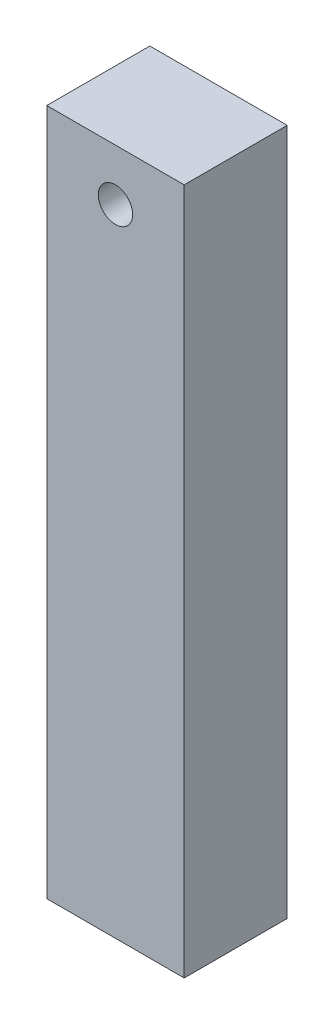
ISO-10303-21;
HEADER;
FILE_DESCRIPTION(('STEP AP214'),'2;1');
FILE_NAME('part.step','',(''),(''),'','','');
FILE_SCHEMA(('AUTOMOTIVE_DESIGN { 1 0 10303 214 1 1 1 1 }'));
ENDSEC;
DATA;
#1=APPLICATION_CONTEXT('core data for automotive mechanical design processes');
#2=APPLICATION_PROTOCOL_DEFINITION('international standard','automotive_design',2000,#1);
#3=PRODUCT_CONTEXT('',#1,'mechanical');
#4=PRODUCT('Part','Part','',(#3));
#5=PRODUCT_RELATED_PRODUCT_CATEGORY('part','',(#4));
#6=PRODUCT_DEFINITION_FORMATION('','',#4);
#7=PRODUCT_DEFINITION_CONTEXT('part definition',#1,'design');
#8=PRODUCT_DEFINITION('design','',#6,#7);
#9=PRODUCT_DEFINITION_SHAPE('','',#8);
#10=(LENGTH_UNIT() NAMED_UNIT(*) SI_UNIT(.MILLI.,.METRE.));
#11=(NAMED_UNIT(*) PLANE_ANGLE_UNIT() SI_UNIT($,.RADIAN.));
#12=(NAMED_UNIT(*) SI_UNIT($,.STERADIAN.) SOLID_ANGLE_UNIT());
#13=UNCERTAINTY_MEASURE_WITH_UNIT(LENGTH_MEASURE(1.E-05),#10,'distance_accuracy_value','');
#14=(GEOMETRIC_REPRESENTATION_CONTEXT(3) GLOBAL_UNCERTAINTY_ASSIGNED_CONTEXT((#13)) GLOBAL_UNIT_ASSIGNED_CONTEXT((#10,
#11,#12)) REPRESENTATION_CONTEXT('',''));
#15=CARTESIAN_POINT('',(0.,0.,0.));
#16=DIRECTION('',(0.,0.,1.));
#17=DIRECTION('',(1.,0.,0.));
#18=AXIS2_PLACEMENT_3D('',#15,#16,#17);
#19=CARTESIAN_POINT('',(0.,40.,0.));
#20=DIRECTION('',(1.,0.,0.));
#21=DIRECTION('',(0.,0.,-1.));
#22=AXIS2_PLACEMENT_3D('',#19,#20,#21);
#23=PLANE('',#22);
#24=DIRECTION('',(0.,0.,1.));
#25=VECTOR('',#24,1.);
#26=CARTESIAN_POINT('',(0.,0.,0.));
#27=LINE('',#26,#25);
#28=CARTESIAN_POINT('',(0.,0.,-6.));
#29=VERTEX_POINT('',#28);
#30=CARTESIAN_POINT('',(0.,0.,0.));
#31=VERTEX_POINT('',#30);
#32=EDGE_CURVE('E70',#29,#31,#27,.T.);
#33=ORIENTED_EDGE('',*,*,#32,.T.);
#34=DIRECTION('',(0.,-1.,0.));
#35=VECTOR('',#34,1.);
#36=CARTESIAN_POINT('',(0.,40.,0.));
#37=LINE('',#36,#35);
#38=CARTESIAN_POINT('',(0.,40.,0.));
#39=VERTEX_POINT('',#38);
#40=EDGE_CURVE('E11',#39,#31,#37,.T.);
#41=ORIENTED_EDGE('',*,*,#40,.F.);
#42=DIRECTION('',(0.,0.,1.));
#43=VECTOR('',#42,1.);
#44=CARTESIAN_POINT('',(0.,40.,0.));
#45=LINE('',#44,#43);
#46=CARTESIAN_POINT('',(0.,40.,-6.));
#47=VERTEX_POINT('',#46);
#48=EDGE_CURVE('E93',#47,#39,#45,.T.);
#49=ORIENTED_EDGE('',*,*,#48,.F.);
#50=DIRECTION('',(0.,-1.,0.));
#51=VECTOR('',#50,1.);
#52=CARTESIAN_POINT('',(0.,40.,-6.));
#53=LINE('',#52,#51);
#54=EDGE_CURVE('E82',#47,#29,#53,.T.);
#55=ORIENTED_EDGE('',*,*,#54,.T.);
#56=EDGE_LOOP('',(#33,#41,#49,#55));
#57=FACE_BOUND('',#56,.T.);
#58=ADVANCED_FACE('F26',(#57),#23,.F.);
#59=CARTESIAN_POINT('',(0.,40.,0.));
#60=DIRECTION('',(0.,0.,-1.));
#61=DIRECTION('',(-1.,0.,0.));
#62=AXIS2_PLACEMENT_3D('',#59,#60,#61);
#63=PLANE('',#62);
#64=CARTESIAN_POINT('',(4.,37.,0.));
#65=DIRECTION('',(0.,0.,1.));
#66=DIRECTION('',(1.,0.,0.));
#67=AXIS2_PLACEMENT_3D('',#64,#65,#66);
#68=CIRCLE('',#67,1.);
#69=CARTESIAN_POINT('',(5.,37.,0.));
#70=VERTEX_POINT('',#69);
#71=EDGE_CURVE('E86',#70,#70,#68,.T.);
#72=ORIENTED_EDGE('',*,*,#71,.F.);
#73=EDGE_LOOP('',(#72));
#74=FACE_BOUND('',#73,.T.);
#75=DIRECTION('',(1.,0.,0.));
#76=VECTOR('',#75,1.);
#77=CARTESIAN_POINT('',(0.,0.,0.));
#78=LINE('',#77,#76);
#79=CARTESIAN_POINT('',(8.,0.,0.));
#80=VERTEX_POINT('',#79);
#81=EDGE_CURVE('E66',#31,#80,#78,.T.);
#82=ORIENTED_EDGE('',*,*,#81,.T.);
#83=DIRECTION('',(0.,-1.,0.));
#84=VECTOR('',#83,1.);
#85=CARTESIAN_POINT('',(8.,40.,0.));
#86=LINE('',#85,#84);
#87=CARTESIAN_POINT('',(8.,40.,0.));
#88=VERTEX_POINT('',#87);
#89=EDGE_CURVE('E33',#88,#80,#86,.T.);
#90=ORIENTED_EDGE('',*,*,#89,.F.);
#91=DIRECTION('',(1.,0.,0.));
#92=VECTOR('',#91,1.);
#93=CARTESIAN_POINT('',(0.,40.,0.));
#94=LINE('',#93,#92);
#95=EDGE_CURVE('E78',#39,#88,#94,.T.);
#96=ORIENTED_EDGE('',*,*,#95,.F.);
#97=ORIENTED_EDGE('',*,*,#40,.T.);
#98=EDGE_LOOP('',(#82,#90,#96,#97));
#99=FACE_BOUND('',#98,.T.);
#100=ADVANCED_FACE('F77',(#74,#99),#63,.F.);
#101=CARTESIAN_POINT('',(8.,40.,0.));
#102=DIRECTION('',(-1.,0.,0.));
#103=DIRECTION('',(0.,0.,1.));
#104=AXIS2_PLACEMENT_3D('',#101,#102,#103);
#105=PLANE('',#104);
#106=DIRECTION('',(0.,0.,-1.));
#107=VECTOR('',#106,1.);
#108=CARTESIAN_POINT('',(8.,0.,0.));
#109=LINE('',#108,#107);
#110=CARTESIAN_POINT('',(8.,0.,-6.));
#111=VERTEX_POINT('',#110);
#112=EDGE_CURVE('E71',#80,#111,#109,.T.);
#113=ORIENTED_EDGE('',*,*,#112,.T.);
#114=DIRECTION('',(0.,-1.,0.));
#115=VECTOR('',#114,1.);
#116=CARTESIAN_POINT('',(8.,40.,-6.));
#117=LINE('',#116,#115);
#118=CARTESIAN_POINT('',(8.,40.,-6.));
#119=VERTEX_POINT('',#118);
#120=EDGE_CURVE('E99',#119,#111,#117,.T.);
#121=ORIENTED_EDGE('',*,*,#120,.F.);
#122=DIRECTION('',(0.,0.,-1.));
#123=VECTOR('',#122,1.);
#124=CARTESIAN_POINT('',(8.,40.,0.));
#125=LINE('',#124,#123);
#126=EDGE_CURVE('E45',#88,#119,#125,.T.);
#127=ORIENTED_EDGE('',*,*,#126,.F.);
#128=ORIENTED_EDGE('',*,*,#89,.T.);
#129=EDGE_LOOP('',(#113,#121,#127,#128));
#130=FACE_BOUND('',#129,.T.);
#131=ADVANCED_FACE('F102',(#130),#105,.F.);
#132=CARTESIAN_POINT('',(0.,40.,-6.));
#133=DIRECTION('',(0.,0.,1.));
#134=DIRECTION('',(1.,0.,0.));
#135=AXIS2_PLACEMENT_3D('',#132,#133,#134);
#136=PLANE('',#135);
#137=CARTESIAN_POINT('',(4.,37.,-6.));
#138=DIRECTION('',(0.,0.,1.));
#139=DIRECTION('',(1.,0.,0.));
#140=AXIS2_PLACEMENT_3D('',#137,#138,#139);
#141=CIRCLE('',#140,1.);
#142=CARTESIAN_POINT('',(5.,37.,-6.));
#143=VERTEX_POINT('',#142);
#144=EDGE_CURVE('E83',#143,#143,#141,.T.);
#145=ORIENTED_EDGE('',*,*,#144,.T.);
#146=EDGE_LOOP('',(#145));
#147=FACE_BOUND('',#146,.T.);
#148=DIRECTION('',(-1.,0.,0.));
#149=VECTOR('',#148,1.);
#150=CARTESIAN_POINT('',(0.,0.,-6.));
#151=LINE('',#150,#149);
#152=EDGE_CURVE('E91',#111,#29,#151,.T.);
#153=ORIENTED_EDGE('',*,*,#152,.T.);
#154=ORIENTED_EDGE('',*,*,#54,.F.);
#155=DIRECTION('',(-1.,0.,0.));
#156=VECTOR('',#155,1.);
#157=CARTESIAN_POINT('',(0.,40.,-6.));
#158=LINE('',#157,#156);
#159=EDGE_CURVE('E40',#119,#47,#158,.T.);
#160=ORIENTED_EDGE('',*,*,#159,.F.);
#161=ORIENTED_EDGE('',*,*,#120,.T.);
#162=EDGE_LOOP('',(#153,#154,#160,#161));
#163=FACE_BOUND('',#162,.T.);
#164=ADVANCED_FACE('F104',(#147,#163),#136,.F.);
#165=CARTESIAN_POINT('',(0.,40.,-6.));
#166=DIRECTION('',(0.,-1.,0.));
#167=DIRECTION('',(0.,0.,-1.));
#168=AXIS2_PLACEMENT_3D('',#165,#166,#167);
#169=PLANE('',#168);
#170=ORIENTED_EDGE('',*,*,#48,.T.);
#171=ORIENTED_EDGE('',*,*,#95,.T.);
#172=ORIENTED_EDGE('',*,*,#126,.T.);
#173=ORIENTED_EDGE('',*,*,#159,.T.);
#174=EDGE_LOOP('',(#170,#171,#172,#173));
#175=FACE_BOUND('',#174,.T.);
#176=ADVANCED_FACE('F105',(#175),#169,.F.);
#177=CARTESIAN_POINT('',(0.,0.,-6.));
#178=DIRECTION('',(0.,-1.,0.));
#179=DIRECTION('',(0.,0.,-1.));
#180=AXIS2_PLACEMENT_3D('',#177,#178,#179);
#181=PLANE('',#180);
#182=ORIENTED_EDGE('',*,*,#32,.F.);
#183=ORIENTED_EDGE('',*,*,#152,.F.);
#184=ORIENTED_EDGE('',*,*,#112,.F.);
#185=ORIENTED_EDGE('',*,*,#81,.F.);
#186=EDGE_LOOP('',(#182,#183,#184,#185));
#187=FACE_BOUND('',#186,.T.);
#188=ADVANCED_FACE('F67',(#187),#181,.T.);
#189=CARTESIAN_POINT('',(4.,37.,-6.));
#190=DIRECTION('',(0.,0.,1.));
#191=DIRECTION('',(1.,0.,0.));
#192=AXIS2_PLACEMENT_3D('',#189,#190,#191);
#193=CYLINDRICAL_SURFACE('',#192,1.);
#194=ORIENTED_EDGE('',*,*,#144,.F.);
#195=EDGE_LOOP('',(#194));
#196=FACE_BOUND('',#195,.T.);
#197=ORIENTED_EDGE('',*,*,#71,.T.);
#198=EDGE_LOOP('',(#197));
#199=FACE_BOUND('',#198,.T.);
#200=ADVANCED_FACE('F112',(#196,#199),#193,.F.);
#201=CLOSED_SHELL('',(#58,#100,#131,#164,#176,#188,#200));
#202=MANIFOLD_SOLID_BREP('B2',#201);
#203=ADVANCED_BREP_SHAPE_REPRESENTATION('',(#18,#202),#14);
#204=SHAPE_DEFINITION_REPRESENTATION(#9,#203);
ENDSEC;
END-ISO-10303-21;
